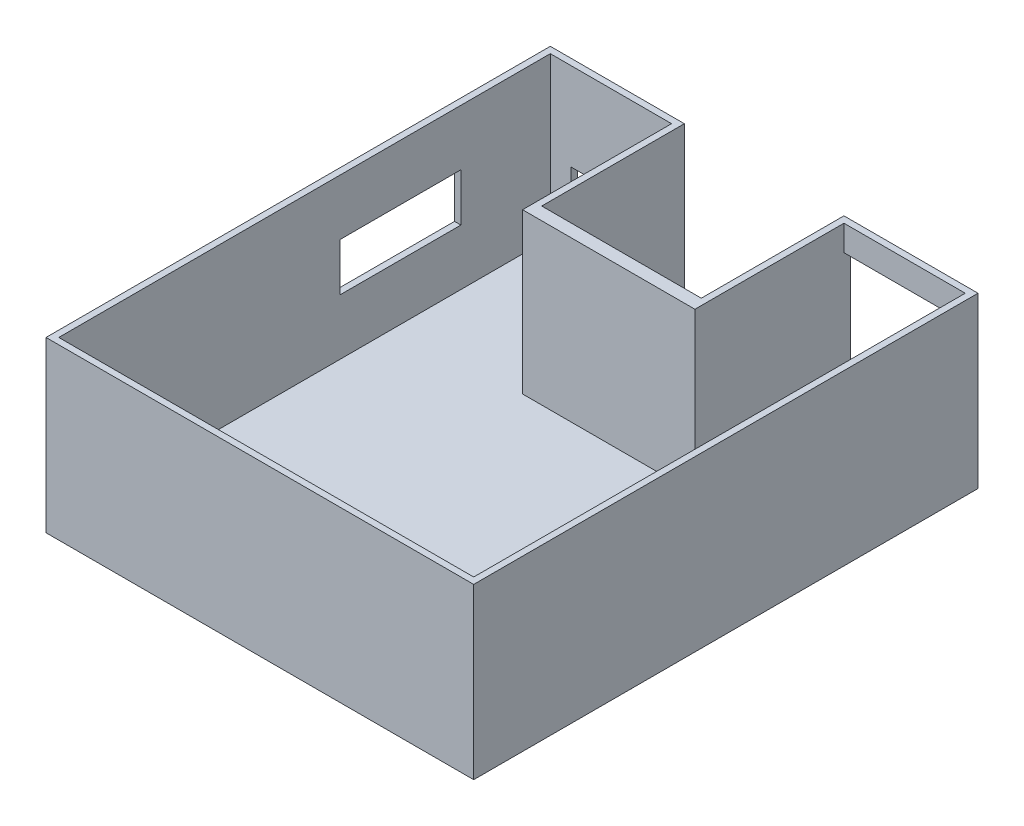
from build123d import *

# Parameters (mm, degrees)
BOSS_EXTRUDE1_DEPTH      = 3
BOSS_EXTRUDE2_DEPTH      = 50
BOSS_EXTRUDE2_DEPTH_BACK = 3
BOSS_EXTRUDE6_DEPTH      = 50
BOSS_EXTRUDE6_DEPTH_BACK = 3
BOSS_EXTRUDE8_DEPTH      = 50
BOSS_EXTRUDE8_DEPTH_BACK = 3
SKETCH7_W                = 50
SKETCH7_H                = 4
SKETCH8_W                = 37
SKETCH8_H                = 42
SKETCH8_W_2              = 25
SKETCH8_H_2              = 10
CUT_EXTRUDE1_DEPTH       = 38
CUT_EXTRUDE2_REACH       = 177.972
SKETCH9_W                = 37.895407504
SKETCH9_H                = 15


with BuildPart() as part:
    # Sketch1 → Boss-Extrude1 (new body)
    with BuildSketch(Plane(origin=(0, 0, 0), x_dir=(1, 0, 0), z_dir=(0, 1, 0))):
        Polygon((-65, -55), (65, -55), (65, 55), (65, 101), (25, 101), (25, 52.311907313), (-25, 52.311907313), (-25, 101), (-65, 101), (-65, 55), align=None)
    extrude(amount=BOSS_EXTRUDE1_DEPTH)



with BuildPart() as body_2:
    # Sketch2 → Boss-Extrude2 (new, two sides: drawn at the far end of the back side and taken through both)
    with BuildSketch(Plane(origin=(0, 3, 0), x_dir=(1, 0, 0), z_dir=(0, 1, 0)).offset(-BOSS_EXTRUDE2_DEPTH_BACK)):
        Polygon((65, -55), (-65, -55), (-65, 101), (-67, 101), (-67, -57), (67, -57), (67, 101), (65, 101), align=None)
    extrude(amount=BOSS_EXTRUDE2_DEPTH + BOSS_EXTRUDE2_DEPTH_BACK)


with BuildPart() as part_1:
    add(part.part)

    add(body_2.part)  # Boss-Extrude6 merges body 2
    # Sketch6 → Boss-Extrude6 (add, two sides: drawn at the far end of the back side and taken through both)
    with BuildSketch(Plane(origin=(0, 3, 0), x_dir=(1, 0, 0), z_dir=(0, 1, 0)).offset(-BOSS_EXTRUDE6_DEPTH_BACK)):
        Polygon((-67, 101), (-25, 101), (-25, 52.311907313), (-27, 52.311907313), (-27, 99), (-67, 99), align=None)
        Polygon((25, 52.311907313), (25, 101), (65, 101), (65, 99), (27, 99), (27, 52.311907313), align=None)
    extrude(amount=BOSS_EXTRUDE6_DEPTH + BOSS_EXTRUDE6_DEPTH_BACK)

    # Sketch7 → Boss-Extrude8 (add, two sides: drawn at the far end of the back side and taken through both)
    with BuildSketch(Plane(origin=(0, 3, 0), x_dir=(1, 0, 0), z_dir=(0, 1, 0)).offset(-BOSS_EXTRUDE8_DEPTH_BACK)):
        with Locations((0, 54.311907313)):
            Rectangle(SKETCH7_W, SKETCH7_H)
    extrude(amount=BOSS_EXTRUDE8_DEPTH + BOSS_EXTRUDE8_DEPTH_BACK)

    # Sketch8 → Cut-Extrude1 (cut)
    with BuildSketch(Plane(origin=(0, 0, -101), x_dir=(-1, 0, 0), z_dir=(0, 0, -1))):
        with Locations((-45.5, 24)):
            Rectangle(SKETCH8_W, SKETCH8_H)
        with Locations((46, 20.5)):
            Rectangle(SKETCH8_W_2, SKETCH8_H_2)
    extrude(amount=-CUT_EXTRUDE1_DEPTH, mode=Mode.SUBTRACT)

    # Sketch9 → Cut-Extrude2 (cut, up to next)
    with BuildSketch(Plane.ZY.offset(67), mode=Mode.PRIVATE) as cut_extrude2_sk1:
        with Locations((-52.052296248, 28)):
            Rectangle(SKETCH9_W, SKETCH9_H)
    cut_extrude2_tool1 = extrude(cut_extrude2_sk1.sketch, amount=-CUT_EXTRUDE2_REACH, mode=Mode.PRIVATE) & part_1.part
    add(cut_extrude2_tool1.solids().sort_by_distance((-67, 28, -52.052296))[0], mode=Mode.SUBTRACT)


solid = part_1.part
